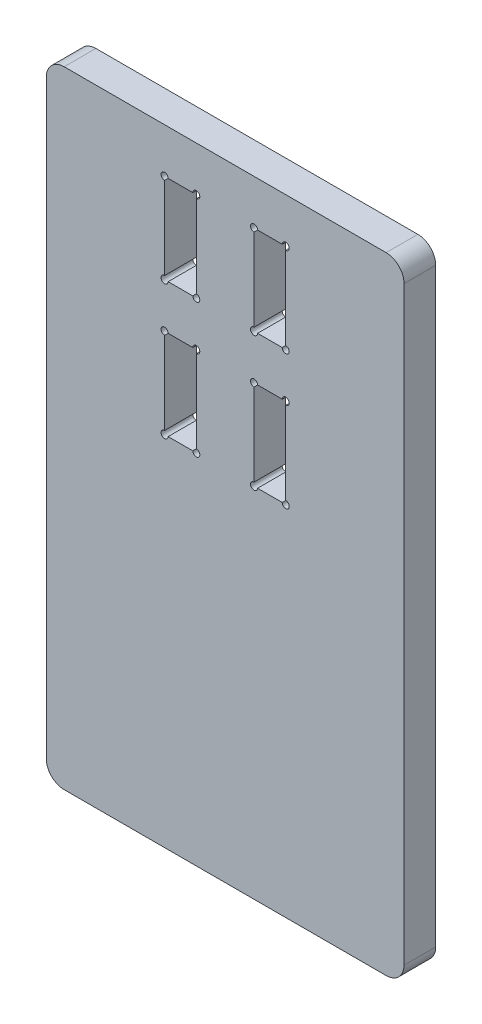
from build123d import *

# Parameters (mm, degrees)
SKETCH1_W           = 50.8
SKETCH1_H           = 88.9
BOSS_EXTRUDE1_DEPTH = 4.5
FILLET1_R           = 2.54


with BuildPart() as part:
    # Sketch1 → Boss-Extrude1 (new body)
    with BuildSketch(Plane.XY):
        with Locations((25.4, 44.45)):
            Rectangle(SKETCH1_W, SKETCH1_H)
        with BuildLine():
            ThreePointArc((29.5, 82.05), (29.146446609, 82.903553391), (30, 82.55))
            Line((30, 82.55), (33.5, 82.55))
            ThreePointArc((33.5, 82.55), (34.353553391, 82.903553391), (34, 82.05))
            Line((34, 82.05), (34, 70.35))
            ThreePointArc((34, 70.35), (34.353553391, 69.496446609), (33.5, 69.85))
            Line((33.5, 69.85), (30, 69.85))
            ThreePointArc((30, 69.85), (29.146446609, 69.496446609), (29.5, 70.35))
            Line((29.5, 70.35), (29.5, 82.05))
        make_face(mode=Mode.SUBTRACT)
        with BuildLine():
            Line((21.3, 63), (21.3, 51.3))
            ThreePointArc((21.3, 51.3), (21.653553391, 50.446446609), (20.8, 50.8))
            Line((20.8, 50.8), (17.3, 50.8))
            ThreePointArc((17.3, 50.8), (16.446446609, 50.446446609), (16.8, 51.3))
            Line((16.8, 51.3), (16.8, 63))
            ThreePointArc((16.8, 63), (16.446446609, 63.853553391), (17.3, 63.5))
            Line((17.3, 63.5), (20.8, 63.5))
            ThreePointArc((20.8, 63.5), (21.653553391, 63.853553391), (21.3, 63))
        make_face(mode=Mode.SUBTRACT)
        with BuildLine():
            Line((17.3, 82.55), (20.8, 82.55))
            ThreePointArc((20.8, 82.55), (21.653553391, 82.903553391), (21.3, 82.05))
            Line((21.3, 82.05), (21.3, 70.35))
            ThreePointArc((21.3, 70.35), (21.653553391, 69.496446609), (20.8, 69.85))
            Line((20.8, 69.85), (17.3, 69.85))
            ThreePointArc((17.3, 69.85), (16.446446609, 69.496446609), (16.8, 70.35))
            Line((16.8, 70.35), (16.8, 82.05))
            ThreePointArc((16.8, 82.05), (16.446446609, 82.903553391), (17.3, 82.55))
        make_face(mode=Mode.SUBTRACT)
        with BuildLine():
            ThreePointArc((34, 51.3), (34.353553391, 50.446446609), (33.5, 50.8))
            Line((33.5, 50.8), (30, 50.8))
            ThreePointArc((30, 50.8), (29.146446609, 50.446446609), (29.5, 51.3))
            Line((29.5, 51.3), (29.5, 63))
            ThreePointArc((29.5, 63), (29.146446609, 63.853553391), (30, 63.5))
            Line((30, 63.5), (33.5, 63.5))
            ThreePointArc((33.5, 63.5), (34.353553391, 63.853553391), (34, 63))
            Line((34, 63), (34, 51.3))
        make_face(mode=Mode.SUBTRACT)
    extrude(amount=BOSS_EXTRUDE1_DEPTH)

    # Fillet1
    fillet1_edges = [part.edges().sort_by_distance(p)[0] for p in [
        (0, 88.9, 2.25),
        (50.8, 88.9, 2.25),
        (50.8, 0, 2.25),
        (0, 0, 2.25),
    ]]
    fillet(fillet1_edges, radius=FILLET1_R)


solid = part.part
